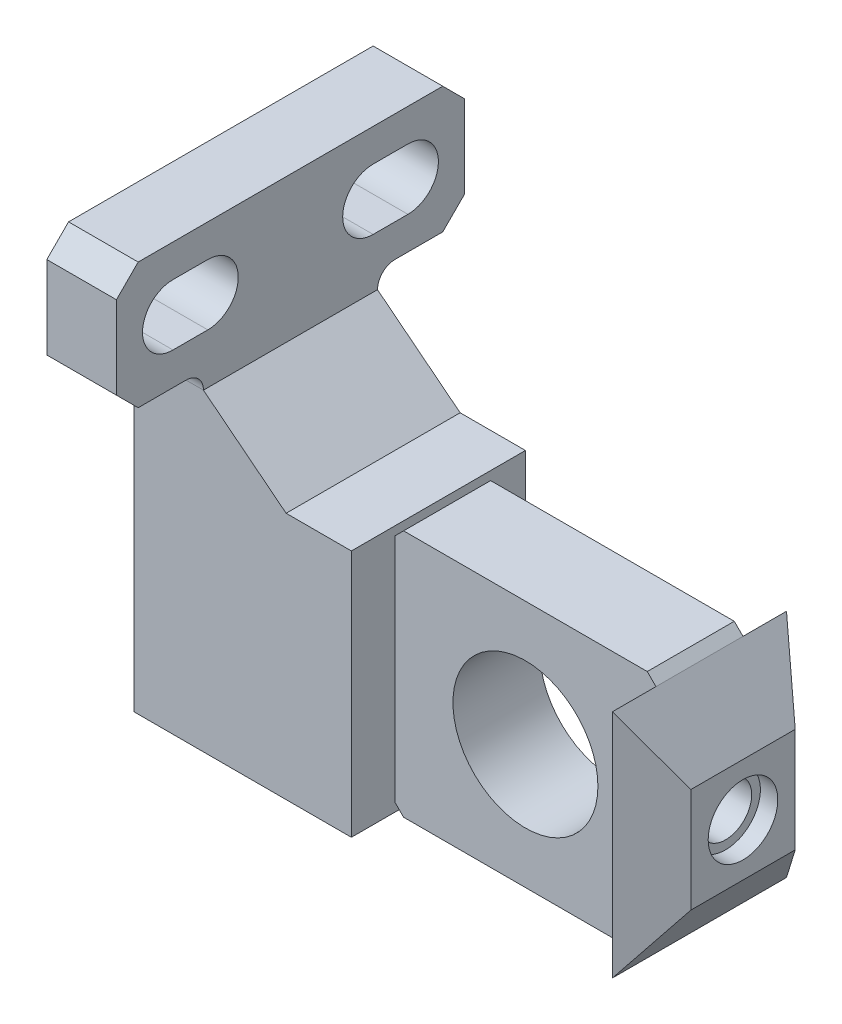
ISO-10303-21;
HEADER;
FILE_DESCRIPTION(('STEP AP214'),'2;1');
FILE_NAME('part.step','',(''),(''),'','','');
FILE_SCHEMA(('AUTOMOTIVE_DESIGN { 1 0 10303 214 1 1 1 1 }'));
ENDSEC;
DATA;
#1=APPLICATION_CONTEXT('core data for automotive mechanical design processes');
#2=APPLICATION_PROTOCOL_DEFINITION('international standard','automotive_design',2000,#1);
#3=PRODUCT_CONTEXT('',#1,'mechanical');
#4=PRODUCT('Part','Part','',(#3));
#5=PRODUCT_RELATED_PRODUCT_CATEGORY('part','',(#4));
#6=PRODUCT_DEFINITION_FORMATION('','',#4);
#7=PRODUCT_DEFINITION_CONTEXT('part definition',#1,'design');
#8=PRODUCT_DEFINITION('design','',#6,#7);
#9=PRODUCT_DEFINITION_SHAPE('','',#8);
#10=(LENGTH_UNIT() NAMED_UNIT(*) SI_UNIT(.MILLI.,.METRE.));
#11=(NAMED_UNIT(*) PLANE_ANGLE_UNIT() SI_UNIT($,.RADIAN.));
#12=(NAMED_UNIT(*) SI_UNIT($,.STERADIAN.) SOLID_ANGLE_UNIT());
#13=UNCERTAINTY_MEASURE_WITH_UNIT(LENGTH_MEASURE(1.E-05),#10,'distance_accuracy_value','');
#14=(GEOMETRIC_REPRESENTATION_CONTEXT(3) GLOBAL_UNCERTAINTY_ASSIGNED_CONTEXT((#13)) GLOBAL_UNIT_ASSIGNED_CONTEXT((#10,
#11,#12)) REPRESENTATION_CONTEXT('',''));
#15=CARTESIAN_POINT('',(0.,0.,0.));
#16=DIRECTION('',(0.,0.,1.));
#17=DIRECTION('',(1.,0.,0.));
#18=AXIS2_PLACEMENT_3D('',#15,#16,#17);
#19=CARTESIAN_POINT('',(-14.,14.25,5.));
#20=DIRECTION('',(0.707106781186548,-0.707106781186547,0.));
#21=DIRECTION('',(0.707106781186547,0.707106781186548,0.));
#22=AXIS2_PLACEMENT_3D('',#19,#20,#21);
#23=PLANE('',#22);
#24=DIRECTION('',(0.,0.,-1.));
#25=VECTOR('',#24,1.);
#26=CARTESIAN_POINT('',(-14.,14.25,5.));
#27=LINE('',#26,#25);
#28=CARTESIAN_POINT('',(-14.,14.25,5.));
#29=VERTEX_POINT('',#28);
#30=CARTESIAN_POINT('',(-14.,14.25,-5.));
#31=VERTEX_POINT('',#30);
#32=EDGE_CURVE('E548',#29,#31,#27,.T.);
#33=ORIENTED_EDGE('',*,*,#32,.T.);
#34=DIRECTION('',(-0.707106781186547,-0.707106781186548,0.));
#35=VECTOR('',#34,1.);
#36=CARTESIAN_POINT('',(-14.,14.25,-5.));
#37=LINE('',#36,#35);
#38=CARTESIAN_POINT('',(-15.,13.25,-5.));
#39=VERTEX_POINT('',#38);
#40=EDGE_CURVE('E510',#31,#39,#37,.T.);
#41=ORIENTED_EDGE('',*,*,#40,.T.);
#42=DIRECTION('',(0.,0.,-1.));
#43=VECTOR('',#42,1.);
#44=CARTESIAN_POINT('',(-15.,13.25,5.));
#45=LINE('',#44,#43);
#46=CARTESIAN_POINT('',(-15.,13.25,5.));
#47=VERTEX_POINT('',#46);
#48=EDGE_CURVE('E11',#47,#39,#45,.T.);
#49=ORIENTED_EDGE('',*,*,#48,.F.);
#50=DIRECTION('',(-0.707106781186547,-0.707106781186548,0.));
#51=VECTOR('',#50,1.);
#52=CARTESIAN_POINT('',(-14.,14.25,5.));
#53=LINE('',#52,#51);
#54=EDGE_CURVE('E533',#29,#47,#53,.T.);
#55=ORIENTED_EDGE('',*,*,#54,.F.);
#56=EDGE_LOOP('',(#33,#41,#49,#55));
#57=FACE_BOUND('',#56,.T.);
#58=ADVANCED_FACE('F35',(#57),#23,.F.);
#59=CARTESIAN_POINT('',(-15.,-13.25,5.));
#60=DIRECTION('',(0.707106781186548,0.707106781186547,0.));
#61=DIRECTION('',(-0.707106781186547,0.707106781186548,0.));
#62=AXIS2_PLACEMENT_3D('',#59,#60,#61);
#63=PLANE('',#62);
#64=DIRECTION('',(0.,0.,-1.));
#65=VECTOR('',#64,1.);
#66=CARTESIAN_POINT('',(-15.,-13.25,5.));
#67=LINE('',#66,#65);
#68=CARTESIAN_POINT('',(-15.,-13.25,5.));
#69=VERTEX_POINT('',#68);
#70=CARTESIAN_POINT('',(-15.,-13.25,-5.));
#71=VERTEX_POINT('',#70);
#72=EDGE_CURVE('E42',#69,#71,#67,.T.);
#73=ORIENTED_EDGE('',*,*,#72,.T.);
#74=DIRECTION('',(0.707106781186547,-0.707106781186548,0.));
#75=VECTOR('',#74,1.);
#76=CARTESIAN_POINT('',(-15.,-13.25,-5.));
#77=LINE('',#76,#75);
#78=CARTESIAN_POINT('',(-14.,-14.25,-5.));
#79=VERTEX_POINT('',#78);
#80=EDGE_CURVE('E516',#71,#79,#77,.T.);
#81=ORIENTED_EDGE('',*,*,#80,.T.);
#82=DIRECTION('',(0.,0.,-1.));
#83=VECTOR('',#82,1.);
#84=CARTESIAN_POINT('',(-14.,-14.25,5.));
#85=LINE('',#84,#83);
#86=CARTESIAN_POINT('',(-14.,-14.25,5.));
#87=VERTEX_POINT('',#86);
#88=EDGE_CURVE('E560',#87,#79,#85,.T.);
#89=ORIENTED_EDGE('',*,*,#88,.F.);
#90=DIRECTION('',(0.707106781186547,-0.707106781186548,0.));
#91=VECTOR('',#90,1.);
#92=CARTESIAN_POINT('',(-15.,-13.25,5.));
#93=LINE('',#92,#91);
#94=EDGE_CURVE('E537',#69,#87,#93,.T.);
#95=ORIENTED_EDGE('',*,*,#94,.F.);
#96=EDGE_LOOP('',(#73,#81,#89,#95));
#97=FACE_BOUND('',#96,.T.);
#98=ADVANCED_FACE('F565',(#97),#63,.F.);
#99=CARTESIAN_POINT('',(-14.,-14.25,5.));
#100=DIRECTION('',(0.,1.,0.));
#101=DIRECTION('',(0.,0.,1.));
#102=AXIS2_PLACEMENT_3D('',#99,#100,#101);
#103=PLANE('',#102);
#104=ORIENTED_EDGE('',*,*,#88,.T.);
#105=DIRECTION('',(1.,0.,0.));
#106=VECTOR('',#105,1.);
#107=CARTESIAN_POINT('',(-14.,-14.25,-5.));
#108=LINE('',#107,#106);
#109=CARTESIAN_POINT('',(14.,-14.25,-5.));
#110=VERTEX_POINT('',#109);
#111=EDGE_CURVE('E519',#79,#110,#108,.T.);
#112=ORIENTED_EDGE('',*,*,#111,.T.);
#113=DIRECTION('',(0.,0.,-1.));
#114=VECTOR('',#113,1.);
#115=CARTESIAN_POINT('',(14.,-14.25,5.));
#116=LINE('',#115,#114);
#117=CARTESIAN_POINT('',(14.,-14.25,5.));
#118=VERTEX_POINT('',#117);
#119=EDGE_CURVE('E558',#118,#110,#116,.T.);
#120=ORIENTED_EDGE('',*,*,#119,.F.);
#121=DIRECTION('',(1.,0.,0.));
#122=VECTOR('',#121,1.);
#123=CARTESIAN_POINT('',(-14.,-14.25,5.));
#124=LINE('',#123,#122);
#125=EDGE_CURVE('E539',#87,#118,#124,.T.);
#126=ORIENTED_EDGE('',*,*,#125,.F.);
#127=EDGE_LOOP('',(#104,#112,#120,#126));
#128=FACE_BOUND('',#127,.T.);
#129=ADVANCED_FACE('F628',(#128),#103,.F.);
#130=CARTESIAN_POINT('',(14.,-14.25,5.));
#131=DIRECTION('',(-0.707106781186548,0.707106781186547,0.));
#132=DIRECTION('',(-0.707106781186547,-0.707106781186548,0.));
#133=AXIS2_PLACEMENT_3D('',#130,#131,#132);
#134=PLANE('',#133);
#135=ORIENTED_EDGE('',*,*,#119,.T.);
#136=DIRECTION('',(0.707106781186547,0.707106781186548,0.));
#137=VECTOR('',#136,1.);
#138=CARTESIAN_POINT('',(14.,-14.25,-5.));
#139=LINE('',#138,#137);
#140=CARTESIAN_POINT('',(15.,-13.25,-5.));
#141=VERTEX_POINT('',#140);
#142=EDGE_CURVE('E522',#110,#141,#139,.T.);
#143=ORIENTED_EDGE('',*,*,#142,.T.);
#144=DIRECTION('',(0.,0.,-1.));
#145=VECTOR('',#144,1.);
#146=CARTESIAN_POINT('',(15.,-13.25,5.));
#147=LINE('',#146,#145);
#148=CARTESIAN_POINT('',(15.,-13.25,5.));
#149=VERTEX_POINT('',#148);
#150=EDGE_CURVE('E555',#149,#141,#147,.T.);
#151=ORIENTED_EDGE('',*,*,#150,.F.);
#152=DIRECTION('',(0.707106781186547,0.707106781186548,0.));
#153=VECTOR('',#152,1.);
#154=CARTESIAN_POINT('',(14.,-14.25,5.));
#155=LINE('',#154,#153);
#156=EDGE_CURVE('E541',#118,#149,#155,.T.);
#157=ORIENTED_EDGE('',*,*,#156,.F.);
#158=EDGE_LOOP('',(#135,#143,#151,#157));
#159=FACE_BOUND('',#158,.T.);
#160=ADVANCED_FACE('F632',(#159),#134,.F.);
#161=CARTESIAN_POINT('',(15.,13.25,5.));
#162=DIRECTION('',(-0.707106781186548,-0.707106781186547,0.));
#163=DIRECTION('',(0.707106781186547,-0.707106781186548,0.));
#164=AXIS2_PLACEMENT_3D('',#161,#162,#163);
#165=PLANE('',#164);
#166=DIRECTION('',(0.,0.,-1.));
#167=VECTOR('',#166,1.);
#168=CARTESIAN_POINT('',(15.,13.25,5.));
#169=LINE('',#168,#167);
#170=CARTESIAN_POINT('',(15.,13.25,5.));
#171=VERTEX_POINT('',#170);
#172=CARTESIAN_POINT('',(15.,13.25,-5.));
#173=VERTEX_POINT('',#172);
#174=EDGE_CURVE('E552',#171,#173,#169,.T.);
#175=ORIENTED_EDGE('',*,*,#174,.T.);
#176=DIRECTION('',(-0.707106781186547,0.707106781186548,0.));
#177=VECTOR('',#176,1.);
#178=CARTESIAN_POINT('',(15.,13.25,-5.));
#179=LINE('',#178,#177);
#180=CARTESIAN_POINT('',(14.,14.25,-5.));
#181=VERTEX_POINT('',#180);
#182=EDGE_CURVE('E527',#173,#181,#179,.T.);
#183=ORIENTED_EDGE('',*,*,#182,.T.);
#184=DIRECTION('',(0.,0.,-1.));
#185=VECTOR('',#184,1.);
#186=CARTESIAN_POINT('',(14.,14.25,5.));
#187=LINE('',#186,#185);
#188=CARTESIAN_POINT('',(14.,14.25,5.));
#189=VERTEX_POINT('',#188);
#190=EDGE_CURVE('E550',#189,#181,#187,.T.);
#191=ORIENTED_EDGE('',*,*,#190,.F.);
#192=DIRECTION('',(-0.707106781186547,0.707106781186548,0.));
#193=VECTOR('',#192,1.);
#194=CARTESIAN_POINT('',(15.,13.25,5.));
#195=LINE('',#194,#193);
#196=EDGE_CURVE('E54',#171,#189,#195,.T.);
#197=ORIENTED_EDGE('',*,*,#196,.F.);
#198=EDGE_LOOP('',(#175,#183,#191,#197));
#199=FACE_BOUND('',#198,.T.);
#200=ADVANCED_FACE('F585',(#199),#165,.F.);
#201=CARTESIAN_POINT('',(14.,14.25,5.));
#202=DIRECTION('',(0.,-1.,0.));
#203=DIRECTION('',(0.,0.,-1.));
#204=AXIS2_PLACEMENT_3D('',#201,#202,#203);
#205=PLANE('',#204);
#206=ORIENTED_EDGE('',*,*,#190,.T.);
#207=DIRECTION('',(-1.,0.,0.));
#208=VECTOR('',#207,1.);
#209=CARTESIAN_POINT('',(14.,14.25,-5.));
#210=LINE('',#209,#208);
#211=EDGE_CURVE('E530',#181,#31,#210,.T.);
#212=ORIENTED_EDGE('',*,*,#211,.T.);
#213=ORIENTED_EDGE('',*,*,#32,.F.);
#214=DIRECTION('',(-1.,0.,0.));
#215=VECTOR('',#214,1.);
#216=CARTESIAN_POINT('',(14.,14.25,5.));
#217=LINE('',#216,#215);
#218=EDGE_CURVE('E49',#189,#29,#217,.T.);
#219=ORIENTED_EDGE('',*,*,#218,.F.);
#220=EDGE_LOOP('',(#206,#212,#213,#219));
#221=FACE_BOUND('',#220,.T.);
#222=ADVANCED_FACE('F580',(#221),#205,.F.);
#223=CARTESIAN_POINT('',(0.,0.,5.));
#224=DIRECTION('',(0.,0.,1.));
#225=DIRECTION('',(1.,0.,0.));
#226=AXIS2_PLACEMENT_3D('',#223,#224,#225);
#227=PLANE('',#226);
#228=CARTESIAN_POINT('',(0.,0.,5.));
#229=DIRECTION('',(0.,0.,1.));
#230=DIRECTION('',(1.,0.,0.));
#231=AXIS2_PLACEMENT_3D('',#228,#229,#230);
#232=CIRCLE('',#231,8.331);
#233=CARTESIAN_POINT('',(8.331,0.,5.));
#234=VERTEX_POINT('',#233);
#235=EDGE_CURVE('E507',#234,#234,#232,.T.);
#236=ORIENTED_EDGE('',*,*,#235,.F.);
#237=EDGE_LOOP('',(#236));
#238=FACE_BOUND('',#237,.T.);
#239=ORIENTED_EDGE('',*,*,#54,.T.);
#240=DIRECTION('',(0.,-1.,0.));
#241=VECTOR('',#240,1.);
#242=CARTESIAN_POINT('',(-15.,13.25,5.));
#243=LINE('',#242,#241);
#244=EDGE_CURVE('E535',#47,#69,#243,.T.);
#245=ORIENTED_EDGE('',*,*,#244,.T.);
#246=ORIENTED_EDGE('',*,*,#94,.T.);
#247=ORIENTED_EDGE('',*,*,#125,.T.);
#248=ORIENTED_EDGE('',*,*,#156,.T.);
#249=DIRECTION('',(0.,1.,0.));
#250=VECTOR('',#249,1.);
#251=CARTESIAN_POINT('',(15.,-13.25,5.));
#252=LINE('',#251,#250);
#253=EDGE_CURVE('E544',#149,#171,#252,.T.);
#254=ORIENTED_EDGE('',*,*,#253,.T.);
#255=ORIENTED_EDGE('',*,*,#196,.T.);
#256=ORIENTED_EDGE('',*,*,#218,.T.);
#257=EDGE_LOOP('',(#239,#245,#246,#247,#248,#254,#255,#256));
#258=FACE_BOUND('',#257,.T.);
#259=ADVANCED_FACE('F592',(#238,#258),#227,.T.);
#260=CARTESIAN_POINT('',(0.,0.,-5.));
#261=DIRECTION('',(0.,0.,1.));
#262=DIRECTION('',(1.,0.,0.));
#263=AXIS2_PLACEMENT_3D('',#260,#261,#262);
#264=PLANE('',#263);
#265=CARTESIAN_POINT('',(0.,0.,-5.));
#266=DIRECTION('',(0.,0.,1.));
#267=DIRECTION('',(1.,0.,0.));
#268=AXIS2_PLACEMENT_3D('',#265,#266,#267);
#269=CIRCLE('',#268,8.331);
#270=CARTESIAN_POINT('',(8.331,0.,-5.));
#271=VERTEX_POINT('',#270);
#272=EDGE_CURVE('E504',#271,#271,#269,.T.);
#273=ORIENTED_EDGE('',*,*,#272,.T.);
#274=EDGE_LOOP('',(#273));
#275=FACE_BOUND('',#274,.T.);
#276=ORIENTED_EDGE('',*,*,#40,.F.);
#277=ORIENTED_EDGE('',*,*,#211,.F.);
#278=ORIENTED_EDGE('',*,*,#182,.F.);
#279=DIRECTION('',(0.,1.,0.));
#280=VECTOR('',#279,1.);
#281=CARTESIAN_POINT('',(15.,-13.25,-5.));
#282=LINE('',#281,#280);
#283=EDGE_CURVE('E525',#141,#173,#282,.T.);
#284=ORIENTED_EDGE('',*,*,#283,.F.);
#285=ORIENTED_EDGE('',*,*,#142,.F.);
#286=ORIENTED_EDGE('',*,*,#111,.F.);
#287=ORIENTED_EDGE('',*,*,#80,.F.);
#288=DIRECTION('',(0.,-1.,0.));
#289=VECTOR('',#288,1.);
#290=CARTESIAN_POINT('',(-15.,13.25,-5.));
#291=LINE('',#290,#289);
#292=EDGE_CURVE('E513',#39,#71,#291,.T.);
#293=ORIENTED_EDGE('',*,*,#292,.F.);
#294=EDGE_LOOP('',(#276,#277,#278,#284,#285,#286,#287,#293));
#295=FACE_BOUND('',#294,.T.);
#296=ADVANCED_FACE('F574',(#275,#295),#264,.F.);
#297=CARTESIAN_POINT('',(0.,0.,-5.));
#298=DIRECTION('',(0.,0.,1.));
#299=DIRECTION('',(1.,0.,0.));
#300=AXIS2_PLACEMENT_3D('',#297,#298,#299);
#301=CYLINDRICAL_SURFACE('',#300,8.331);
#302=ORIENTED_EDGE('',*,*,#235,.T.);
#303=EDGE_LOOP('',(#302));
#304=FACE_BOUND('',#303,.T.);
#305=ORIENTED_EDGE('',*,*,#272,.F.);
#306=EDGE_LOOP('',(#305));
#307=FACE_BOUND('',#306,.T.);
#308=ADVANCED_FACE('F648',(#304,#307),#301,.F.);
#309=CARTESIAN_POINT('',(15.,13.25,10.));
#310=DIRECTION('',(1.,0.,0.));
#311=DIRECTION('',(0.,0.,-1.));
#312=AXIS2_PLACEMENT_3D('',#309,#310,#311);
#313=PLANE('',#312);
#314=DIRECTION('',(0.,0.,-1.));
#315=VECTOR('',#314,1.);
#316=CARTESIAN_POINT('',(15.,-13.25,10.));
#317=LINE('',#316,#315);
#318=CARTESIAN_POINT('',(15.,-13.25,-10.));
#319=VERTEX_POINT('',#318);
#320=EDGE_CURVE('E497',#141,#319,#317,.T.);
#321=ORIENTED_EDGE('',*,*,#320,.F.);
#322=ORIENTED_EDGE('',*,*,#283,.T.);
#323=DIRECTION('',(0.,0.,-1.));
#324=VECTOR('',#323,1.);
#325=CARTESIAN_POINT('',(15.,13.25,10.));
#326=LINE('',#325,#324);
#327=CARTESIAN_POINT('',(15.,13.25,-10.));
#328=VERTEX_POINT('',#327);
#329=EDGE_CURVE('E501',#173,#328,#326,.T.);
#330=ORIENTED_EDGE('',*,*,#329,.T.);
#331=DIRECTION('',(0.,-1.,0.));
#332=VECTOR('',#331,1.);
#333=CARTESIAN_POINT('',(15.,13.25,-10.));
#334=LINE('',#333,#332);
#335=EDGE_CURVE('E486',#328,#319,#334,.T.);
#336=ORIENTED_EDGE('',*,*,#335,.T.);
#337=EDGE_LOOP('',(#321,#322,#330,#336));
#338=FACE_BOUND('',#337,.T.);
#339=ADVANCED_FACE('F611',(#338),#313,.F.);
#340=CARTESIAN_POINT('',(20.,6.00000000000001,10.));
#341=DIRECTION('',(-0.823212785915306,-0.56773295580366,0.));
#342=DIRECTION('',(0.56773295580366,-0.823212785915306,0.));
#343=AXIS2_PLACEMENT_3D('',#340,#341,#342);
#344=PLANE('',#343);
#345=CARTESIAN_POINT('',(15.,13.25,10.));
#346=VERTEX_POINT('',#345);
#347=EDGE_CURVE('E502',#346,#171,#326,.T.);
#348=ORIENTED_EDGE('',*,*,#347,.F.);
#349=DIRECTION('',(0.516914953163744,-0.749526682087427,-0.413531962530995));
#350=VECTOR('',#349,1.);
#351=CARTESIAN_POINT('',(19.1449565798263,7.23981295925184,6.68403473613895));
#352=LINE('',#351,#350);
#353=CARTESIAN_POINT('',(20.,6.00000000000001,6.));
#354=VERTEX_POINT('',#353);
#355=EDGE_CURVE('E483',#346,#354,#352,.T.);
#356=ORIENTED_EDGE('',*,*,#355,.T.);
#357=DIRECTION('',(0.,0.,-1.));
#358=VECTOR('',#357,1.);
#359=CARTESIAN_POINT('',(20.,6.00000000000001,10.));
#360=LINE('',#359,#358);
#361=CARTESIAN_POINT('',(20.,6.00000000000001,-6.00000000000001));
#362=VERTEX_POINT('',#361);
#363=EDGE_CURVE('E491',#354,#362,#360,.T.);
#364=ORIENTED_EDGE('',*,*,#363,.T.);
#365=DIRECTION('',(-0.516914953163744,0.749526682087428,-0.413531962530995));
#366=VECTOR('',#365,1.);
#367=CARTESIAN_POINT('',(23.4201736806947,1.04074816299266,-3.26386105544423));
#368=LINE('',#367,#366);
#369=EDGE_CURVE('E477',#362,#328,#368,.T.);
#370=ORIENTED_EDGE('',*,*,#369,.T.);
#371=ORIENTED_EDGE('',*,*,#329,.F.);
#372=ORIENTED_EDGE('',*,*,#174,.F.);
#373=EDGE_LOOP('',(#348,#356,#364,#370,#371,#372));
#374=FACE_BOUND('',#373,.T.);
#375=ADVANCED_FACE('F590',(#374),#344,.F.);
#376=ORIENTED_EDGE('',*,*,#253,.F.);
#377=CARTESIAN_POINT('',(15.,-13.25,10.));
#378=VERTEX_POINT('',#377);
#379=EDGE_CURVE('E498',#378,#149,#317,.T.);
#380=ORIENTED_EDGE('',*,*,#379,.F.);
#381=DIRECTION('',(0.,-1.,0.));
#382=VECTOR('',#381,1.);
#383=CARTESIAN_POINT('',(15.,13.25,10.));
#384=LINE('',#383,#382);
#385=EDGE_CURVE('E489',#346,#378,#384,.T.);
#386=ORIENTED_EDGE('',*,*,#385,.F.);
#387=ORIENTED_EDGE('',*,*,#347,.T.);
#388=EDGE_LOOP('',(#376,#380,#386,#387));
#389=FACE_BOUND('',#388,.T.);
#390=ADVANCED_FACE('F597',(#389),#313,.F.);
#391=CARTESIAN_POINT('',(15.,-13.25,10.));
#392=DIRECTION('',(-0.823212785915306,0.56773295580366,0.));
#393=DIRECTION('',(-0.56773295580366,-0.823212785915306,0.));
#394=AXIS2_PLACEMENT_3D('',#391,#392,#393);
#395=PLANE('',#394);
#396=DIRECTION('',(0.,0.,-1.));
#397=VECTOR('',#396,1.);
#398=CARTESIAN_POINT('',(20.,-6.,10.));
#399=LINE('',#398,#397);
#400=CARTESIAN_POINT('',(20.,-6.,6.));
#401=VERTEX_POINT('',#400);
#402=CARTESIAN_POINT('',(20.,-6.,-6.00000000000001));
#403=VERTEX_POINT('',#402);
#404=EDGE_CURVE('E494',#401,#403,#399,.T.);
#405=ORIENTED_EDGE('',*,*,#404,.F.);
#406=DIRECTION('',(-0.516914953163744,-0.749526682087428,0.413531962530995));
#407=VECTOR('',#406,1.);
#408=CARTESIAN_POINT('',(15.,-13.25,10.));
#409=LINE('',#408,#407);
#410=EDGE_CURVE('E480',#401,#378,#409,.T.);
#411=ORIENTED_EDGE('',*,*,#410,.T.);
#412=ORIENTED_EDGE('',*,*,#379,.T.);
#413=ORIENTED_EDGE('',*,*,#150,.T.);
#414=ORIENTED_EDGE('',*,*,#320,.T.);
#415=DIRECTION('',(0.516914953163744,0.749526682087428,0.413531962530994));
#416=VECTOR('',#415,1.);
#417=CARTESIAN_POINT('',(19.2752171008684,-7.05093520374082,-6.57982631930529));
#418=LINE('',#417,#416);
#419=EDGE_CURVE('E472',#319,#403,#418,.T.);
#420=ORIENTED_EDGE('',*,*,#419,.T.);
#421=EDGE_LOOP('',(#405,#411,#412,#413,#414,#420));
#422=FACE_BOUND('',#421,.T.);
#423=ADVANCED_FACE('F601',(#422),#395,.F.);
#424=CARTESIAN_POINT('',(20.,-6.,10.));
#425=DIRECTION('',(-1.,0.,0.));
#426=DIRECTION('',(0.,0.,1.));
#427=AXIS2_PLACEMENT_3D('',#424,#425,#426);
#428=PLANE('',#427);
#429=CARTESIAN_POINT('',(20.,0.,0.));
#430=DIRECTION('',(-1.,0.,0.));
#431=DIRECTION('',(0.,0.,1.));
#432=AXIS2_PLACEMENT_3D('',#429,#430,#431);
#433=CIRCLE('',#432,4.);
#434=CARTESIAN_POINT('',(20.,0.,4.));
#435=VERTEX_POINT('',#434);
#436=EDGE_CURVE('E457',#435,#435,#433,.T.);
#437=ORIENTED_EDGE('',*,*,#436,.T.);
#438=EDGE_LOOP('',(#437));
#439=FACE_BOUND('',#438,.T.);
#440=ORIENTED_EDGE('',*,*,#363,.F.);
#441=DIRECTION('',(0.,1.,0.));
#442=VECTOR('',#441,1.);
#443=CARTESIAN_POINT('',(20.,-13.25,6.));
#444=LINE('',#443,#442);
#445=EDGE_CURVE('E470',#401,#354,#444,.T.);
#446=ORIENTED_EDGE('',*,*,#445,.F.);
#447=ORIENTED_EDGE('',*,*,#404,.T.);
#448=DIRECTION('',(0.,1.,0.));
#449=VECTOR('',#448,1.);
#450=CARTESIAN_POINT('',(20.,-13.25,-6.00000000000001));
#451=LINE('',#450,#449);
#452=EDGE_CURVE('E469',#403,#362,#451,.T.);
#453=ORIENTED_EDGE('',*,*,#452,.T.);
#454=EDGE_LOOP('',(#440,#446,#447,#453));
#455=FACE_BOUND('',#454,.T.);
#456=ADVANCED_FACE('F608',(#439,#455),#428,.F.);
#457=CARTESIAN_POINT('',(15.,-13.25,-10.));
#458=DIRECTION('',(-0.624695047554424,0.,0.780868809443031));
#459=DIRECTION('',(0.780868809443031,0.,0.624695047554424));
#460=AXIS2_PLACEMENT_3D('',#457,#458,#459);
#461=PLANE('',#460);
#462=ORIENTED_EDGE('',*,*,#452,.F.);
#463=ORIENTED_EDGE('',*,*,#419,.F.);
#464=ORIENTED_EDGE('',*,*,#335,.F.);
#465=ORIENTED_EDGE('',*,*,#369,.F.);
#466=EDGE_LOOP('',(#462,#463,#464,#465));
#467=FACE_BOUND('',#466,.T.);
#468=ADVANCED_FACE('F612',(#467),#461,.F.);
#469=CARTESIAN_POINT('',(20.,-13.25,6.));
#470=DIRECTION('',(-0.624695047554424,0.,-0.78086880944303));
#471=DIRECTION('',(-0.78086880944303,0.,0.624695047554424));
#472=AXIS2_PLACEMENT_3D('',#469,#470,#471);
#473=PLANE('',#472);
#474=ORIENTED_EDGE('',*,*,#385,.T.);
#475=ORIENTED_EDGE('',*,*,#410,.F.);
#476=ORIENTED_EDGE('',*,*,#445,.T.);
#477=ORIENTED_EDGE('',*,*,#355,.F.);
#478=EDGE_LOOP('',(#474,#475,#476,#477));
#479=FACE_BOUND('',#478,.T.);
#480=ADVANCED_FACE('F605',(#479),#473,.F.);
#481=CARTESIAN_POINT('',(12.,0.,0.));
#482=DIRECTION('',(1.,0.,0.));
#483=DIRECTION('',(0.,0.,-1.));
#484=AXIS2_PLACEMENT_3D('',#481,#482,#483);
#485=PLANE('',#484);
#486=CARTESIAN_POINT('',(12.,0.,0.));
#487=DIRECTION('',(-1.,0.,0.));
#488=DIRECTION('',(0.,0.,1.));
#489=AXIS2_PLACEMENT_3D('',#486,#487,#488);
#490=CIRCLE('',#489,3.);
#491=CARTESIAN_POINT('',(12.,0.,3.));
#492=VERTEX_POINT('',#491);
#493=EDGE_CURVE('E466',#492,#492,#490,.T.);
#494=ORIENTED_EDGE('',*,*,#493,.F.);
#495=EDGE_LOOP('',(#494));
#496=FACE_BOUND('',#495,.T.);
#497=ADVANCED_FACE('F619',(#496),#485,.T.);
#498=CARTESIAN_POINT('',(20.,0.,0.));
#499=DIRECTION('',(-1.,0.,0.));
#500=DIRECTION('',(0.,0.,1.));
#501=AXIS2_PLACEMENT_3D('',#498,#499,#500);
#502=CYLINDRICAL_SURFACE('',#501,3.);
#503=ORIENTED_EDGE('',*,*,#493,.T.);
#504=EDGE_LOOP('',(#503));
#505=FACE_BOUND('',#504,.T.);
#506=CARTESIAN_POINT('',(18.,0.,0.));
#507=DIRECTION('',(-1.,0.,0.));
#508=DIRECTION('',(0.,0.,1.));
#509=AXIS2_PLACEMENT_3D('',#506,#507,#508);
#510=CIRCLE('',#509,3.);
#511=CARTESIAN_POINT('',(18.,0.,3.));
#512=VERTEX_POINT('',#511);
#513=EDGE_CURVE('E463',#512,#512,#510,.T.);
#514=ORIENTED_EDGE('',*,*,#513,.F.);
#515=EDGE_LOOP('',(#514));
#516=FACE_BOUND('',#515,.T.);
#517=ADVANCED_FACE('F800',(#505,#516),#502,.F.);
#518=CARTESIAN_POINT('',(18.,3.,0.));
#519=DIRECTION('',(1.,0.,0.));
#520=DIRECTION('',(0.,0.,-1.));
#521=AXIS2_PLACEMENT_3D('',#518,#519,#520);
#522=PLANE('',#521);
#523=ORIENTED_EDGE('',*,*,#513,.T.);
#524=EDGE_LOOP('',(#523));
#525=FACE_BOUND('',#524,.T.);
#526=CARTESIAN_POINT('',(18.,0.,0.));
#527=DIRECTION('',(-1.,0.,0.));
#528=DIRECTION('',(0.,0.,1.));
#529=AXIS2_PLACEMENT_3D('',#526,#527,#528);
#530=CIRCLE('',#529,4.);
#531=CARTESIAN_POINT('',(18.,0.,4.));
#532=VERTEX_POINT('',#531);
#533=EDGE_CURVE('E460',#532,#532,#530,.T.);
#534=ORIENTED_EDGE('',*,*,#533,.F.);
#535=EDGE_LOOP('',(#534));
#536=FACE_BOUND('',#535,.T.);
#537=ADVANCED_FACE('F831',(#525,#536),#522,.T.);
#538=CARTESIAN_POINT('',(20.,0.,0.));
#539=DIRECTION('',(-1.,0.,0.));
#540=DIRECTION('',(0.,0.,1.));
#541=AXIS2_PLACEMENT_3D('',#538,#539,#540);
#542=CYLINDRICAL_SURFACE('',#541,4.);
#543=ORIENTED_EDGE('',*,*,#533,.T.);
#544=EDGE_LOOP('',(#543));
#545=FACE_BOUND('',#544,.T.);
#546=ORIENTED_EDGE('',*,*,#436,.F.);
#547=EDGE_LOOP('',(#546));
#548=FACE_BOUND('',#547,.T.);
#549=ADVANCED_FACE('F836',(#545,#548),#542,.F.);
#550=CARTESIAN_POINT('',(-40.,21.75,10.));
#551=DIRECTION('',(1.,0.,0.));
#552=DIRECTION('',(0.,0.,-1.));
#553=AXIS2_PLACEMENT_3D('',#550,#551,#552);
#554=PLANE('',#553);
#555=DIRECTION('',(0.,-1.,0.));
#556=VECTOR('',#555,1.);
#557=CARTESIAN_POINT('',(-40.,21.75,10.));
#558=LINE('',#557,#556);
#559=CARTESIAN_POINT('',(-40.,21.75,10.));
#560=VERTEX_POINT('',#559);
#561=CARTESIAN_POINT('',(-40.,-14.25,10.));
#562=VERTEX_POINT('',#561);
#563=EDGE_CURVE('E436',#560,#562,#558,.T.);
#564=ORIENTED_EDGE('',*,*,#563,.F.);
#565=CARTESIAN_POINT('',(-40.,21.75,12.));
#566=DIRECTION('',(-1.,0.,0.));
#567=DIRECTION('',(0.,0.,1.));
#568=AXIS2_PLACEMENT_3D('',#565,#566,#567);
#569=CIRCLE('',#568,2.);
#570=CARTESIAN_POINT('',(-40.,23.75,12.));
#571=VERTEX_POINT('',#570);
#572=EDGE_CURVE('E372',#571,#560,#569,.T.);
#573=ORIENTED_EDGE('',*,*,#572,.F.);
#574=DIRECTION('',(0.,0.,-1.));
#575=VECTOR('',#574,1.);
#576=CARTESIAN_POINT('',(-40.,23.75,17.5));
#577=LINE('',#576,#575);
#578=CARTESIAN_POINT('',(-40.,23.75,17.5));
#579=VERTEX_POINT('',#578);
#580=EDGE_CURVE('E370',#579,#571,#577,.T.);
#581=ORIENTED_EDGE('',*,*,#580,.F.);
#582=DIRECTION('',(0.,-0.707106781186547,-0.707106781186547));
#583=VECTOR('',#582,1.);
#584=CARTESIAN_POINT('',(-40.,26.25,20.));
#585=LINE('',#584,#583);
#586=CARTESIAN_POINT('',(-40.,26.25,20.));
#587=VERTEX_POINT('',#586);
#588=EDGE_CURVE('E368',#587,#579,#585,.T.);
#589=ORIENTED_EDGE('',*,*,#588,.F.);
#590=DIRECTION('',(0.,-1.,0.));
#591=VECTOR('',#590,1.);
#592=CARTESIAN_POINT('',(-40.,35.75,20.));
#593=LINE('',#592,#591);
#594=CARTESIAN_POINT('',(-40.,35.75,20.));
#595=VERTEX_POINT('',#594);
#596=EDGE_CURVE('E340',#595,#587,#593,.T.);
#597=ORIENTED_EDGE('',*,*,#596,.F.);
#598=DIRECTION('',(0.,-0.707106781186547,0.707106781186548));
#599=VECTOR('',#598,1.);
#600=CARTESIAN_POINT('',(-40.,38.25,17.5));
#601=LINE('',#600,#599);
#602=CARTESIAN_POINT('',(-40.,38.25,17.5));
#603=VERTEX_POINT('',#602);
#604=EDGE_CURVE('E345',#603,#595,#601,.T.);
#605=ORIENTED_EDGE('',*,*,#604,.F.);
#606=DIRECTION('',(0.,0.,1.));
#607=VECTOR('',#606,1.);
#608=CARTESIAN_POINT('',(-40.,38.25,-17.5));
#609=LINE('',#608,#607);
#610=CARTESIAN_POINT('',(-40.,38.25,-17.5));
#611=VERTEX_POINT('',#610);
#612=EDGE_CURVE('E384',#611,#603,#609,.T.);
#613=ORIENTED_EDGE('',*,*,#612,.F.);
#614=DIRECTION('',(0.,0.707106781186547,0.707106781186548));
#615=VECTOR('',#614,1.);
#616=CARTESIAN_POINT('',(-40.,35.75,-20.));
#617=LINE('',#616,#615);
#618=CARTESIAN_POINT('',(-40.,35.75,-20.));
#619=VERTEX_POINT('',#618);
#620=EDGE_CURVE('E382',#619,#611,#617,.T.);
#621=ORIENTED_EDGE('',*,*,#620,.F.);
#622=DIRECTION('',(0.,1.,0.));
#623=VECTOR('',#622,1.);
#624=CARTESIAN_POINT('',(-40.,26.25,-20.));
#625=LINE('',#624,#623);
#626=CARTESIAN_POINT('',(-40.,26.25,-20.));
#627=VERTEX_POINT('',#626);
#628=EDGE_CURVE('E380',#627,#619,#625,.T.);
#629=ORIENTED_EDGE('',*,*,#628,.F.);
#630=DIRECTION('',(0.,0.707106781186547,-0.707106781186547));
#631=VECTOR('',#630,1.);
#632=CARTESIAN_POINT('',(-40.,23.75,-17.5));
#633=LINE('',#632,#631);
#634=CARTESIAN_POINT('',(-40.,23.75,-17.5));
#635=VERTEX_POINT('',#634);
#636=EDGE_CURVE('E378',#635,#627,#633,.T.);
#637=ORIENTED_EDGE('',*,*,#636,.F.);
#638=DIRECTION('',(0.,0.,-1.));
#639=VECTOR('',#638,1.);
#640=CARTESIAN_POINT('',(-40.,23.75,-12.));
#641=LINE('',#640,#639);
#642=CARTESIAN_POINT('',(-40.,23.75,-12.));
#643=VERTEX_POINT('',#642);
#644=EDGE_CURVE('E376',#643,#635,#641,.T.);
#645=ORIENTED_EDGE('',*,*,#644,.F.);
#646=CARTESIAN_POINT('',(-40.,21.75,-12.));
#647=DIRECTION('',(-1.,0.,0.));
#648=DIRECTION('',(0.,0.,1.));
#649=AXIS2_PLACEMENT_3D('',#646,#647,#648);
#650=CIRCLE('',#649,2.);
#651=CARTESIAN_POINT('',(-40.,21.75,-10.));
#652=VERTEX_POINT('',#651);
#653=EDGE_CURVE('E374',#652,#643,#650,.T.);
#654=ORIENTED_EDGE('',*,*,#653,.F.);
#655=DIRECTION('',(0.,-1.,0.));
#656=VECTOR('',#655,1.);
#657=CARTESIAN_POINT('',(-40.,21.75,-10.));
#658=LINE('',#657,#656);
#659=CARTESIAN_POINT('',(-40.,-14.25,-10.));
#660=VERTEX_POINT('',#659);
#661=EDGE_CURVE('E418',#652,#660,#658,.T.);
#662=ORIENTED_EDGE('',*,*,#661,.T.);
#663=DIRECTION('',(0.,0.,-1.));
#664=VECTOR('',#663,1.);
#665=CARTESIAN_POINT('',(-40.,-14.25,10.));
#666=LINE('',#665,#664);
#667=EDGE_CURVE('E455',#562,#660,#666,.T.);
#668=ORIENTED_EDGE('',*,*,#667,.F.);
#669=EDGE_LOOP('',(#564,#573,#581,#589,#597,#605,#613,#621,#629,#637,#645,#654,#662,#668));
#670=FACE_BOUND('',#669,.T.);
#671=DIRECTION('',(0.,0.,1.));
#672=VECTOR('',#671,1.);
#673=CARTESIAN_POINT('',(-40.,34.5,-13.5));
#674=LINE('',#673,#672);
#675=CARTESIAN_POINT('',(-40.,34.5,-13.5));
#676=VERTEX_POINT('',#675);
#677=CARTESIAN_POINT('',(-40.,34.5,-9.5));
#678=VERTEX_POINT('',#677);
#679=EDGE_CURVE('E313',#676,#678,#674,.T.);
#680=ORIENTED_EDGE('',*,*,#679,.T.);
#681=CARTESIAN_POINT('',(-40.,31.,-9.5));
#682=DIRECTION('',(1.,0.,0.));
#683=DIRECTION('',(0.,0.,-1.));
#684=AXIS2_PLACEMENT_3D('',#681,#682,#683);
#685=CIRCLE('',#684,3.5);
#686=CARTESIAN_POINT('',(-40.,27.5,-9.5));
#687=VERTEX_POINT('',#686);
#688=EDGE_CURVE('E286',#678,#687,#685,.T.);
#689=ORIENTED_EDGE('',*,*,#688,.T.);
#690=DIRECTION('',(0.,0.,-1.));
#691=VECTOR('',#690,1.);
#692=CARTESIAN_POINT('',(-40.,27.5,-9.5));
#693=LINE('',#692,#691);
#694=CARTESIAN_POINT('',(-40.,27.5,-13.5));
#695=VERTEX_POINT('',#694);
#696=EDGE_CURVE('E323',#687,#695,#693,.T.);
#697=ORIENTED_EDGE('',*,*,#696,.T.);
#698=CARTESIAN_POINT('',(-40.,31.,-13.5));
#699=DIRECTION('',(1.,0.,0.));
#700=DIRECTION('',(0.,0.,-1.));
#701=AXIS2_PLACEMENT_3D('',#698,#699,#700);
#702=CIRCLE('',#701,3.5);
#703=EDGE_CURVE('E326',#695,#676,#702,.T.);
#704=ORIENTED_EDGE('',*,*,#703,.T.);
#705=EDGE_LOOP('',(#680,#689,#697,#704));
#706=FACE_BOUND('',#705,.T.);
#707=DIRECTION('',(0.,0.,1.));
#708=VECTOR('',#707,1.);
#709=CARTESIAN_POINT('',(-40.,34.5,9.5));
#710=LINE('',#709,#708);
#711=CARTESIAN_POINT('',(-40.,34.5,9.5));
#712=VERTEX_POINT('',#711);
#713=CARTESIAN_POINT('',(-40.,34.5,13.5));
#714=VERTEX_POINT('',#713);
#715=EDGE_CURVE('E279',#712,#714,#710,.T.);
#716=ORIENTED_EDGE('',*,*,#715,.T.);
#717=CARTESIAN_POINT('',(-40.,31.,13.5));
#718=DIRECTION('',(1.,0.,0.));
#719=DIRECTION('',(0.,0.,-1.));
#720=AXIS2_PLACEMENT_3D('',#717,#718,#719);
#721=CIRCLE('',#720,3.5);
#722=CARTESIAN_POINT('',(-40.,27.5,13.5));
#723=VERTEX_POINT('',#722);
#724=EDGE_CURVE('E298',#714,#723,#721,.T.);
#725=ORIENTED_EDGE('',*,*,#724,.T.);
#726=DIRECTION('',(0.,0.,-1.));
#727=VECTOR('',#726,1.);
#728=CARTESIAN_POINT('',(-40.,27.5,13.5));
#729=LINE('',#728,#727);
#730=CARTESIAN_POINT('',(-40.,27.5,9.5));
#731=VERTEX_POINT('',#730);
#732=EDGE_CURVE('E285',#723,#731,#729,.T.);
#733=ORIENTED_EDGE('',*,*,#732,.T.);
#734=CARTESIAN_POINT('',(-40.,31.,9.5));
#735=DIRECTION('',(1.,0.,0.));
#736=DIRECTION('',(0.,0.,-1.));
#737=AXIS2_PLACEMENT_3D('',#734,#735,#736);
#738=CIRCLE('',#737,3.5);
#739=EDGE_CURVE('E301',#731,#712,#738,.T.);
#740=ORIENTED_EDGE('',*,*,#739,.T.);
#741=EDGE_LOOP('',(#716,#725,#733,#740));
#742=FACE_BOUND('',#741,.T.);
#743=ADVANCED_FACE('F867',(#670,#706,#742),#554,.F.);
#744=CARTESIAN_POINT('',(-40.,-14.25,10.));
#745=DIRECTION('',(0.,1.,0.));
#746=DIRECTION('',(0.,0.,1.));
#747=AXIS2_PLACEMENT_3D('',#744,#745,#746);
#748=PLANE('',#747);
#749=ORIENTED_EDGE('',*,*,#667,.T.);
#750=DIRECTION('',(1.,0.,0.));
#751=VECTOR('',#750,1.);
#752=CARTESIAN_POINT('',(-40.,-14.25,-10.));
#753=LINE('',#752,#751);
#754=CARTESIAN_POINT('',(-15.,-14.25,-10.));
#755=VERTEX_POINT('',#754);
#756=EDGE_CURVE('E421',#660,#755,#753,.T.);
#757=ORIENTED_EDGE('',*,*,#756,.T.);
#758=DIRECTION('',(0.,0.,-1.));
#759=VECTOR('',#758,1.);
#760=CARTESIAN_POINT('',(-15.,-14.25,10.));
#761=LINE('',#760,#759);
#762=CARTESIAN_POINT('',(-15.,-14.25,10.));
#763=VERTEX_POINT('',#762);
#764=EDGE_CURVE('E453',#763,#755,#761,.T.);
#765=ORIENTED_EDGE('',*,*,#764,.F.);
#766=DIRECTION('',(1.,0.,0.));
#767=VECTOR('',#766,1.);
#768=CARTESIAN_POINT('',(-40.,-14.25,10.));
#769=LINE('',#768,#767);
#770=EDGE_CURVE('E438',#562,#763,#769,.T.);
#771=ORIENTED_EDGE('',*,*,#770,.F.);
#772=EDGE_LOOP('',(#749,#757,#765,#771));
#773=FACE_BOUND('',#772,.T.);
#774=ADVANCED_FACE('F872',(#773),#748,.F.);
#775=CARTESIAN_POINT('',(-15.,-14.25,10.));
#776=DIRECTION('',(-1.,0.,0.));
#777=DIRECTION('',(0.,0.,1.));
#778=AXIS2_PLACEMENT_3D('',#775,#776,#777);
#779=PLANE('',#778);
#780=ORIENTED_EDGE('',*,*,#244,.F.);
#781=ORIENTED_EDGE('',*,*,#48,.T.);
#782=ORIENTED_EDGE('',*,*,#292,.T.);
#783=ORIENTED_EDGE('',*,*,#72,.F.);
#784=EDGE_LOOP('',(#780,#781,#782,#783));
#785=FACE_BOUND('',#784,.T.);
#786=ORIENTED_EDGE('',*,*,#764,.T.);
#787=DIRECTION('',(0.,1.,0.));
#788=VECTOR('',#787,1.);
#789=CARTESIAN_POINT('',(-15.,-14.25,-10.));
#790=LINE('',#789,#788);
#791=CARTESIAN_POINT('',(-15.,14.25,-10.));
#792=VERTEX_POINT('',#791);
#793=EDGE_CURVE('E424',#755,#792,#790,.T.);
#794=ORIENTED_EDGE('',*,*,#793,.T.);
#795=DIRECTION('',(0.,0.,-1.));
#796=VECTOR('',#795,1.);
#797=CARTESIAN_POINT('',(-15.,14.25,10.));
#798=LINE('',#797,#796);
#799=CARTESIAN_POINT('',(-15.,14.25,10.));
#800=VERTEX_POINT('',#799);
#801=EDGE_CURVE('E451',#800,#792,#798,.T.);
#802=ORIENTED_EDGE('',*,*,#801,.F.);
#803=DIRECTION('',(0.,1.,0.));
#804=VECTOR('',#803,1.);
#805=CARTESIAN_POINT('',(-15.,-14.25,10.));
#806=LINE('',#805,#804);
#807=EDGE_CURVE('E440',#763,#800,#806,.T.);
#808=ORIENTED_EDGE('',*,*,#807,.F.);
#809=EDGE_LOOP('',(#786,#794,#802,#808));
#810=FACE_BOUND('',#809,.T.);
#811=ADVANCED_FACE('F569',(#785,#810),#779,.F.);
#812=CARTESIAN_POINT('',(-15.,14.25,10.));
#813=DIRECTION('',(0.,-1.,0.));
#814=DIRECTION('',(0.,0.,-1.));
#815=AXIS2_PLACEMENT_3D('',#812,#813,#814);
#816=PLANE('',#815);
#817=ORIENTED_EDGE('',*,*,#801,.T.);
#818=DIRECTION('',(-1.,0.,0.));
#819=VECTOR('',#818,1.);
#820=CARTESIAN_POINT('',(-15.,14.25,-10.));
#821=LINE('',#820,#819);
#822=CARTESIAN_POINT('',(-22.5,14.25,-10.));
#823=VERTEX_POINT('',#822);
#824=EDGE_CURVE('E427',#792,#823,#821,.T.);
#825=ORIENTED_EDGE('',*,*,#824,.T.);
#826=DIRECTION('',(0.,0.,-1.));
#827=VECTOR('',#826,1.);
#828=CARTESIAN_POINT('',(-22.5,14.25,10.));
#829=LINE('',#828,#827);
#830=CARTESIAN_POINT('',(-22.5,14.25,10.));
#831=VERTEX_POINT('',#830);
#832=EDGE_CURVE('E449',#831,#823,#829,.T.);
#833=ORIENTED_EDGE('',*,*,#832,.F.);
#834=DIRECTION('',(-1.,0.,0.));
#835=VECTOR('',#834,1.);
#836=CARTESIAN_POINT('',(-15.,14.25,10.));
#837=LINE('',#836,#835);
#838=EDGE_CURVE('E442',#800,#831,#837,.T.);
#839=ORIENTED_EDGE('',*,*,#838,.F.);
#840=EDGE_LOOP('',(#817,#825,#833,#839));
#841=FACE_BOUND('',#840,.T.);
#842=ADVANCED_FACE('F978',(#841),#816,.F.);
#843=CARTESIAN_POINT('',(-22.5,14.25,10.));
#844=DIRECTION('',(-0.619644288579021,-0.784882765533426,0.));
#845=DIRECTION('',(0.784882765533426,-0.619644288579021,0.));
#846=AXIS2_PLACEMENT_3D('',#843,#844,#845);
#847=PLANE('',#846);
#848=ORIENTED_EDGE('',*,*,#832,.T.);
#849=DIRECTION('',(-0.784882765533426,0.619644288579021,0.));
#850=VECTOR('',#849,1.);
#851=CARTESIAN_POINT('',(-22.5,14.25,-10.));
#852=LINE('',#851,#850);
#853=CARTESIAN_POINT('',(-32.,21.75,-10.));
#854=VERTEX_POINT('',#853);
#855=EDGE_CURVE('E430',#823,#854,#852,.T.);
#856=ORIENTED_EDGE('',*,*,#855,.T.);
#857=DIRECTION('',(0.,0.,-1.));
#858=VECTOR('',#857,1.);
#859=CARTESIAN_POINT('',(-32.,21.75,10.));
#860=LINE('',#859,#858);
#861=CARTESIAN_POINT('',(-32.,21.75,10.));
#862=VERTEX_POINT('',#861);
#863=EDGE_CURVE('E447',#862,#854,#860,.T.);
#864=ORIENTED_EDGE('',*,*,#863,.F.);
#865=DIRECTION('',(-0.784882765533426,0.619644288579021,0.));
#866=VECTOR('',#865,1.);
#867=CARTESIAN_POINT('',(-22.5,14.25,10.));
#868=LINE('',#867,#866);
#869=EDGE_CURVE('E444',#831,#862,#868,.T.);
#870=ORIENTED_EDGE('',*,*,#869,.F.);
#871=EDGE_LOOP('',(#848,#856,#864,#870));
#872=FACE_BOUND('',#871,.T.);
#873=ADVANCED_FACE('F963',(#872),#847,.F.);
#874=CARTESIAN_POINT('',(0.,0.,10.));
#875=DIRECTION('',(0.,0.,1.));
#876=DIRECTION('',(1.,0.,0.));
#877=AXIS2_PLACEMENT_3D('',#874,#875,#876);
#878=PLANE('',#877);
#879=DIRECTION('',(-1.,0.,0.));
#880=VECTOR('',#879,1.);
#881=CARTESIAN_POINT('',(-32.,21.75,10.));
#882=LINE('',#881,#880);
#883=EDGE_CURVE('E433',#862,#560,#882,.T.);
#884=ORIENTED_EDGE('',*,*,#883,.T.);
#885=ORIENTED_EDGE('',*,*,#563,.T.);
#886=ORIENTED_EDGE('',*,*,#770,.T.);
#887=ORIENTED_EDGE('',*,*,#807,.T.);
#888=ORIENTED_EDGE('',*,*,#838,.T.);
#889=ORIENTED_EDGE('',*,*,#869,.T.);
#890=EDGE_LOOP('',(#884,#885,#886,#887,#888,#889));
#891=FACE_BOUND('',#890,.T.);
#892=ADVANCED_FACE('F959',(#891),#878,.T.);
#893=CARTESIAN_POINT('',(0.,0.,-10.));
#894=DIRECTION('',(0.,0.,1.));
#895=DIRECTION('',(1.,0.,0.));
#896=AXIS2_PLACEMENT_3D('',#893,#894,#895);
#897=PLANE('',#896);
#898=DIRECTION('',(-1.,0.,0.));
#899=VECTOR('',#898,1.);
#900=CARTESIAN_POINT('',(-32.,21.75,-10.));
#901=LINE('',#900,#899);
#902=EDGE_CURVE('E416',#854,#652,#901,.T.);
#903=ORIENTED_EDGE('',*,*,#902,.F.);
#904=ORIENTED_EDGE('',*,*,#855,.F.);
#905=ORIENTED_EDGE('',*,*,#824,.F.);
#906=ORIENTED_EDGE('',*,*,#793,.F.);
#907=ORIENTED_EDGE('',*,*,#756,.F.);
#908=ORIENTED_EDGE('',*,*,#661,.F.);
#909=EDGE_LOOP('',(#903,#904,#905,#906,#907,#908));
#910=FACE_BOUND('',#909,.T.);
#911=ADVANCED_FACE('F676',(#910),#897,.F.);
#912=CARTESIAN_POINT('',(-32.,21.75,12.));
#913=DIRECTION('',(-1.,0.,0.));
#914=DIRECTION('',(0.,0.,1.));
#915=AXIS2_PLACEMENT_3D('',#912,#913,#914);
#916=PLANE('',#915);
#917=CARTESIAN_POINT('',(-32.,31.,-9.5));
#918=DIRECTION('',(1.,0.,0.));
#919=DIRECTION('',(0.,0.,-1.));
#920=AXIS2_PLACEMENT_3D('',#917,#918,#919);
#921=CIRCLE('',#920,3.5);
#922=CARTESIAN_POINT('',(-32.,34.5,-9.5));
#923=VERTEX_POINT('',#922);
#924=CARTESIAN_POINT('',(-32.,27.5,-9.5));
#925=VERTEX_POINT('',#924);
#926=EDGE_CURVE('E310',#923,#925,#921,.T.);
#927=ORIENTED_EDGE('',*,*,#926,.F.);
#928=DIRECTION('',(0.,0.,1.));
#929=VECTOR('',#928,1.);
#930=CARTESIAN_POINT('',(-32.,34.5,-13.5));
#931=LINE('',#930,#929);
#932=CARTESIAN_POINT('',(-32.,34.5,-13.5));
#933=VERTEX_POINT('',#932);
#934=EDGE_CURVE('E318',#933,#923,#931,.T.);
#935=ORIENTED_EDGE('',*,*,#934,.F.);
#936=CARTESIAN_POINT('',(-32.,31.,-13.5));
#937=DIRECTION('',(1.,0.,0.));
#938=DIRECTION('',(0.,0.,-1.));
#939=AXIS2_PLACEMENT_3D('',#936,#937,#938);
#940=CIRCLE('',#939,3.5);
#941=CARTESIAN_POINT('',(-32.,27.5,-13.5));
#942=VERTEX_POINT('',#941);
#943=EDGE_CURVE('E315',#942,#933,#940,.T.);
#944=ORIENTED_EDGE('',*,*,#943,.F.);
#945=DIRECTION('',(0.,0.,-1.));
#946=VECTOR('',#945,1.);
#947=CARTESIAN_POINT('',(-32.,27.5,-9.5));
#948=LINE('',#947,#946);
#949=EDGE_CURVE('E312',#925,#942,#948,.T.);
#950=ORIENTED_EDGE('',*,*,#949,.F.);
#951=EDGE_LOOP('',(#927,#935,#944,#950));
#952=FACE_BOUND('',#951,.T.);
#953=DIRECTION('',(0.,-1.,0.));
#954=VECTOR('',#953,1.);
#955=CARTESIAN_POINT('',(-32.,35.75,20.));
#956=LINE('',#955,#954);
#957=CARTESIAN_POINT('',(-32.,35.75,20.));
#958=VERTEX_POINT('',#957);
#959=CARTESIAN_POINT('',(-32.,26.25,20.));
#960=VERTEX_POINT('',#959);
#961=EDGE_CURVE('E341',#958,#960,#956,.T.);
#962=ORIENTED_EDGE('',*,*,#961,.T.);
#963=DIRECTION('',(0.,-0.707106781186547,-0.707106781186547));
#964=VECTOR('',#963,1.);
#965=CARTESIAN_POINT('',(-32.,26.25,20.));
#966=LINE('',#965,#964);
#967=CARTESIAN_POINT('',(-32.,23.75,17.5));
#968=VERTEX_POINT('',#967);
#969=EDGE_CURVE('E344',#960,#968,#966,.T.);
#970=ORIENTED_EDGE('',*,*,#969,.T.);
#971=DIRECTION('',(0.,0.,-1.));
#972=VECTOR('',#971,1.);
#973=CARTESIAN_POINT('',(-32.,23.75,17.5));
#974=LINE('',#973,#972);
#975=CARTESIAN_POINT('',(-32.,23.75,12.));
#976=VERTEX_POINT('',#975);
#977=EDGE_CURVE('E347',#968,#976,#974,.T.);
#978=ORIENTED_EDGE('',*,*,#977,.T.);
#979=CARTESIAN_POINT('',(-32.,21.75,12.));
#980=DIRECTION('',(-1.,0.,0.));
#981=DIRECTION('',(0.,0.,1.));
#982=AXIS2_PLACEMENT_3D('',#979,#980,#981);
#983=CIRCLE('',#982,2.);
#984=EDGE_CURVE('E349',#976,#862,#983,.T.);
#985=ORIENTED_EDGE('',*,*,#984,.T.);
#986=ORIENTED_EDGE('',*,*,#863,.T.);
#987=CARTESIAN_POINT('',(-32.,21.75,-12.));
#988=DIRECTION('',(-1.,0.,0.));
#989=DIRECTION('',(0.,0.,1.));
#990=AXIS2_PLACEMENT_3D('',#987,#988,#989);
#991=CIRCLE('',#990,2.);
#992=CARTESIAN_POINT('',(-32.,23.75,-12.));
#993=VERTEX_POINT('',#992);
#994=EDGE_CURVE('E351',#854,#993,#991,.T.);
#995=ORIENTED_EDGE('',*,*,#994,.T.);
#996=DIRECTION('',(0.,0.,-1.));
#997=VECTOR('',#996,1.);
#998=CARTESIAN_POINT('',(-32.,23.75,-12.));
#999=LINE('',#998,#997);
#1000=CARTESIAN_POINT('',(-32.,23.75,-17.5));
#1001=VERTEX_POINT('',#1000);
#1002=EDGE_CURVE('E353',#993,#1001,#999,.T.);
#1003=ORIENTED_EDGE('',*,*,#1002,.T.);
#1004=DIRECTION('',(0.,0.707106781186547,-0.707106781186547));
#1005=VECTOR('',#1004,1.);
#1006=CARTESIAN_POINT('',(-32.,23.75,-17.5));
#1007=LINE('',#1006,#1005);
#1008=CARTESIAN_POINT('',(-32.,26.25,-20.));
#1009=VERTEX_POINT('',#1008);
#1010=EDGE_CURVE('E355',#1001,#1009,#1007,.T.);
#1011=ORIENTED_EDGE('',*,*,#1010,.T.);
#1012=DIRECTION('',(0.,1.,0.));
#1013=VECTOR('',#1012,1.);
#1014=CARTESIAN_POINT('',(-32.,26.25,-20.));
#1015=LINE('',#1014,#1013);
#1016=CARTESIAN_POINT('',(-32.,35.75,-20.));
#1017=VERTEX_POINT('',#1016);
#1018=EDGE_CURVE('E357',#1009,#1017,#1015,.T.);
#1019=ORIENTED_EDGE('',*,*,#1018,.T.);
#1020=DIRECTION('',(0.,0.707106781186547,0.707106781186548));
#1021=VECTOR('',#1020,1.);
#1022=CARTESIAN_POINT('',(-32.,35.75,-20.));
#1023=LINE('',#1022,#1021);
#1024=CARTESIAN_POINT('',(-32.,38.25,-17.5));
#1025=VERTEX_POINT('',#1024);
#1026=EDGE_CURVE('E359',#1017,#1025,#1023,.T.);
#1027=ORIENTED_EDGE('',*,*,#1026,.T.);
#1028=DIRECTION('',(0.,0.,1.));
#1029=VECTOR('',#1028,1.);
#1030=CARTESIAN_POINT('',(-32.,38.25,-17.5));
#1031=LINE('',#1030,#1029);
#1032=CARTESIAN_POINT('',(-32.,38.25,17.5));
#1033=VERTEX_POINT('',#1032);
#1034=EDGE_CURVE('E361',#1025,#1033,#1031,.T.);
#1035=ORIENTED_EDGE('',*,*,#1034,.T.);
#1036=DIRECTION('',(0.,-0.707106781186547,0.707106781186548));
#1037=VECTOR('',#1036,1.);
#1038=CARTESIAN_POINT('',(-32.,38.25,17.5));
#1039=LINE('',#1038,#1037);
#1040=EDGE_CURVE('E363',#1033,#958,#1039,.T.);
#1041=ORIENTED_EDGE('',*,*,#1040,.T.);
#1042=EDGE_LOOP('',(#962,#970,#978,#985,#986,#995,#1003,#1011,#1019,#1027,#1035,#1041));
#1043=FACE_BOUND('',#1042,.T.);
#1044=CARTESIAN_POINT('',(-32.,31.,13.5));
#1045=DIRECTION('',(1.,0.,0.));
#1046=DIRECTION('',(0.,0.,-1.));
#1047=AXIS2_PLACEMENT_3D('',#1044,#1045,#1046);
#1048=CIRCLE('',#1047,3.5);
#1049=CARTESIAN_POINT('',(-32.,34.5,13.5));
#1050=VERTEX_POINT('',#1049);
#1051=CARTESIAN_POINT('',(-32.,27.5,13.5));
#1052=VERTEX_POINT('',#1051);
#1053=EDGE_CURVE('E268',#1050,#1052,#1048,.T.);
#1054=ORIENTED_EDGE('',*,*,#1053,.F.);
#1055=DIRECTION('',(0.,0.,1.));
#1056=VECTOR('',#1055,1.);
#1057=CARTESIAN_POINT('',(-32.,34.5,9.5));
#1058=LINE('',#1057,#1056);
#1059=CARTESIAN_POINT('',(-32.,34.5,9.5));
#1060=VERTEX_POINT('',#1059);
#1061=EDGE_CURVE('E294',#1060,#1050,#1058,.T.);
#1062=ORIENTED_EDGE('',*,*,#1061,.F.);
#1063=CARTESIAN_POINT('',(-32.,31.,9.5));
#1064=DIRECTION('',(1.,0.,0.));
#1065=DIRECTION('',(0.,0.,-1.));
#1066=AXIS2_PLACEMENT_3D('',#1063,#1064,#1065);
#1067=CIRCLE('',#1066,3.5);
#1068=CARTESIAN_POINT('',(-32.,27.5,9.5));
#1069=VERTEX_POINT('',#1068);
#1070=EDGE_CURVE('E292',#1069,#1060,#1067,.T.);
#1071=ORIENTED_EDGE('',*,*,#1070,.F.);
#1072=DIRECTION('',(0.,0.,-1.));
#1073=VECTOR('',#1072,1.);
#1074=CARTESIAN_POINT('',(-32.,27.5,13.5));
#1075=LINE('',#1074,#1073);
#1076=EDGE_CURVE('E278',#1052,#1069,#1075,.T.);
#1077=ORIENTED_EDGE('',*,*,#1076,.F.);
#1078=EDGE_LOOP('',(#1054,#1062,#1071,#1077));
#1079=FACE_BOUND('',#1078,.T.);
#1080=ADVANCED_FACE('F290',(#952,#1043,#1079),#916,.F.);
#1081=CARTESIAN_POINT('',(-32.,35.75,20.));
#1082=DIRECTION('',(0.,0.,-1.));
#1083=DIRECTION('',(-1.,0.,0.));
#1084=AXIS2_PLACEMENT_3D('',#1081,#1082,#1083);
#1085=PLANE('',#1084);
#1086=ORIENTED_EDGE('',*,*,#596,.T.);
#1087=DIRECTION('',(-1.,0.,0.));
#1088=VECTOR('',#1087,1.);
#1089=CARTESIAN_POINT('',(-32.,26.25,20.));
#1090=LINE('',#1089,#1088);
#1091=EDGE_CURVE('E413',#960,#587,#1090,.T.);
#1092=ORIENTED_EDGE('',*,*,#1091,.F.);
#1093=ORIENTED_EDGE('',*,*,#961,.F.);
#1094=DIRECTION('',(-1.,0.,0.));
#1095=VECTOR('',#1094,1.);
#1096=CARTESIAN_POINT('',(-32.,35.75,20.));
#1097=LINE('',#1096,#1095);
#1098=EDGE_CURVE('E365',#958,#595,#1097,.T.);
#1099=ORIENTED_EDGE('',*,*,#1098,.T.);
#1100=EDGE_LOOP('',(#1086,#1092,#1093,#1099));
#1101=FACE_BOUND('',#1100,.T.);
#1102=ADVANCED_FACE('F715',(#1101),#1085,.F.);
#1103=CARTESIAN_POINT('',(-32.,26.25,20.));
#1104=DIRECTION('',(0.,0.707106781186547,-0.707106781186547));
#1105=DIRECTION('',(0.,0.707106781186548,0.707106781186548));
#1106=AXIS2_PLACEMENT_3D('',#1103,#1104,#1105);
#1107=PLANE('',#1106);
#1108=ORIENTED_EDGE('',*,*,#588,.T.);
#1109=DIRECTION('',(-1.,0.,0.));
#1110=VECTOR('',#1109,1.);
#1111=CARTESIAN_POINT('',(-32.,23.75,17.5));
#1112=LINE('',#1111,#1110);
#1113=EDGE_CURVE('E410',#968,#579,#1112,.T.);
#1114=ORIENTED_EDGE('',*,*,#1113,.F.);
#1115=ORIENTED_EDGE('',*,*,#969,.F.);
#1116=ORIENTED_EDGE('',*,*,#1091,.T.);
#1117=EDGE_LOOP('',(#1108,#1114,#1115,#1116));
#1118=FACE_BOUND('',#1117,.T.);
#1119=ADVANCED_FACE('F754',(#1118),#1107,.F.);
#1120=CARTESIAN_POINT('',(-32.,23.75,17.5));
#1121=DIRECTION('',(0.,1.,0.));
#1122=DIRECTION('',(0.,0.,1.));
#1123=AXIS2_PLACEMENT_3D('',#1120,#1121,#1122);
#1124=PLANE('',#1123);
#1125=ORIENTED_EDGE('',*,*,#580,.T.);
#1126=DIRECTION('',(-1.,0.,0.));
#1127=VECTOR('',#1126,1.);
#1128=CARTESIAN_POINT('',(-32.,23.75,12.));
#1129=LINE('',#1128,#1127);
#1130=EDGE_CURVE('E407',#976,#571,#1129,.T.);
#1131=ORIENTED_EDGE('',*,*,#1130,.F.);
#1132=ORIENTED_EDGE('',*,*,#977,.F.);
#1133=ORIENTED_EDGE('',*,*,#1113,.T.);
#1134=EDGE_LOOP('',(#1125,#1131,#1132,#1133));
#1135=FACE_BOUND('',#1134,.T.);
#1136=ADVANCED_FACE('F790',(#1135),#1124,.F.);
#1137=CARTESIAN_POINT('',(-32.,21.75,12.));
#1138=DIRECTION('',(-1.,0.,0.));
#1139=DIRECTION('',(0.,0.,1.));
#1140=AXIS2_PLACEMENT_3D('',#1137,#1138,#1139);
#1141=CYLINDRICAL_SURFACE('',#1140,2.);
#1142=ORIENTED_EDGE('',*,*,#572,.T.);
#1143=ORIENTED_EDGE('',*,*,#883,.F.);
#1144=ORIENTED_EDGE('',*,*,#984,.F.);
#1145=ORIENTED_EDGE('',*,*,#1130,.T.);
#1146=EDGE_LOOP('',(#1142,#1143,#1144,#1145));
#1147=FACE_BOUND('',#1146,.T.);
#1148=ADVANCED_FACE('F823',(#1147),#1141,.F.);
#1149=CARTESIAN_POINT('',(-32.,21.75,-12.));
#1150=DIRECTION('',(-1.,0.,0.));
#1151=DIRECTION('',(0.,0.,1.));
#1152=AXIS2_PLACEMENT_3D('',#1149,#1150,#1151);
#1153=CYLINDRICAL_SURFACE('',#1152,2.);
#1154=ORIENTED_EDGE('',*,*,#653,.T.);
#1155=DIRECTION('',(-1.,0.,0.));
#1156=VECTOR('',#1155,1.);
#1157=CARTESIAN_POINT('',(-32.,23.75,-12.));
#1158=LINE('',#1157,#1156);
#1159=EDGE_CURVE('E404',#993,#643,#1158,.T.);
#1160=ORIENTED_EDGE('',*,*,#1159,.F.);
#1161=ORIENTED_EDGE('',*,*,#994,.F.);
#1162=ORIENTED_EDGE('',*,*,#902,.T.);
#1163=EDGE_LOOP('',(#1154,#1160,#1161,#1162));
#1164=FACE_BOUND('',#1163,.T.);
#1165=ADVANCED_FACE('F857',(#1164),#1153,.F.);
#1166=CARTESIAN_POINT('',(-32.,23.75,-12.));
#1167=DIRECTION('',(0.,1.,0.));
#1168=DIRECTION('',(0.,0.,1.));
#1169=AXIS2_PLACEMENT_3D('',#1166,#1167,#1168);
#1170=PLANE('',#1169);
#1171=ORIENTED_EDGE('',*,*,#644,.T.);
#1172=DIRECTION('',(-1.,0.,0.));
#1173=VECTOR('',#1172,1.);
#1174=CARTESIAN_POINT('',(-32.,23.75,-17.5));
#1175=LINE('',#1174,#1173);
#1176=EDGE_CURVE('E401',#1001,#635,#1175,.T.);
#1177=ORIENTED_EDGE('',*,*,#1176,.F.);
#1178=ORIENTED_EDGE('',*,*,#1002,.F.);
#1179=ORIENTED_EDGE('',*,*,#1159,.T.);
#1180=EDGE_LOOP('',(#1171,#1177,#1178,#1179));
#1181=FACE_BOUND('',#1180,.T.);
#1182=ADVANCED_FACE('F851',(#1181),#1170,.F.);
#1183=CARTESIAN_POINT('',(-32.,23.75,-17.5));
#1184=DIRECTION('',(0.,0.707106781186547,0.707106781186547));
#1185=DIRECTION('',(0.,-0.707106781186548,0.707106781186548));
#1186=AXIS2_PLACEMENT_3D('',#1183,#1184,#1185);
#1187=PLANE('',#1186);
#1188=ORIENTED_EDGE('',*,*,#636,.T.);
#1189=DIRECTION('',(-1.,0.,0.));
#1190=VECTOR('',#1189,1.);
#1191=CARTESIAN_POINT('',(-32.,26.25,-20.));
#1192=LINE('',#1191,#1190);
#1193=EDGE_CURVE('E398',#1009,#627,#1192,.T.);
#1194=ORIENTED_EDGE('',*,*,#1193,.F.);
#1195=ORIENTED_EDGE('',*,*,#1010,.F.);
#1196=ORIENTED_EDGE('',*,*,#1176,.T.);
#1197=EDGE_LOOP('',(#1188,#1194,#1195,#1196));
#1198=FACE_BOUND('',#1197,.T.);
#1199=ADVANCED_FACE('F856',(#1198),#1187,.F.);
#1200=CARTESIAN_POINT('',(-32.,26.25,-20.));
#1201=DIRECTION('',(0.,0.,1.));
#1202=DIRECTION('',(1.,0.,0.));
#1203=AXIS2_PLACEMENT_3D('',#1200,#1201,#1202);
#1204=PLANE('',#1203);
#1205=ORIENTED_EDGE('',*,*,#628,.T.);
#1206=DIRECTION('',(-1.,0.,0.));
#1207=VECTOR('',#1206,1.);
#1208=CARTESIAN_POINT('',(-32.,35.75,-20.));
#1209=LINE('',#1208,#1207);
#1210=EDGE_CURVE('E395',#1017,#619,#1209,.T.);
#1211=ORIENTED_EDGE('',*,*,#1210,.F.);
#1212=ORIENTED_EDGE('',*,*,#1018,.F.);
#1213=ORIENTED_EDGE('',*,*,#1193,.T.);
#1214=EDGE_LOOP('',(#1205,#1211,#1212,#1213));
#1215=FACE_BOUND('',#1214,.T.);
#1216=ADVANCED_FACE('F914',(#1215),#1204,.F.);
#1217=CARTESIAN_POINT('',(-32.,35.75,-20.));
#1218=DIRECTION('',(0.,-0.707106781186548,0.707106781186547));
#1219=DIRECTION('',(0.,-0.707106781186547,-0.707106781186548));
#1220=AXIS2_PLACEMENT_3D('',#1217,#1218,#1219);
#1221=PLANE('',#1220);
#1222=ORIENTED_EDGE('',*,*,#620,.T.);
#1223=DIRECTION('',(-1.,0.,0.));
#1224=VECTOR('',#1223,1.);
#1225=CARTESIAN_POINT('',(-32.,38.25,-17.5));
#1226=LINE('',#1225,#1224);
#1227=EDGE_CURVE('E392',#1025,#611,#1226,.T.);
#1228=ORIENTED_EDGE('',*,*,#1227,.F.);
#1229=ORIENTED_EDGE('',*,*,#1026,.F.);
#1230=ORIENTED_EDGE('',*,*,#1210,.T.);
#1231=EDGE_LOOP('',(#1222,#1228,#1229,#1230));
#1232=FACE_BOUND('',#1231,.T.);
#1233=ADVANCED_FACE('F918',(#1232),#1221,.F.);
#1234=CARTESIAN_POINT('',(-32.,38.25,-17.5));
#1235=DIRECTION('',(0.,-1.,0.));
#1236=DIRECTION('',(0.,0.,-1.));
#1237=AXIS2_PLACEMENT_3D('',#1234,#1235,#1236);
#1238=PLANE('',#1237);
#1239=ORIENTED_EDGE('',*,*,#612,.T.);
#1240=DIRECTION('',(-1.,0.,0.));
#1241=VECTOR('',#1240,1.);
#1242=CARTESIAN_POINT('',(-32.,38.25,17.5));
#1243=LINE('',#1242,#1241);
#1244=EDGE_CURVE('E389',#1033,#603,#1243,.T.);
#1245=ORIENTED_EDGE('',*,*,#1244,.F.);
#1246=ORIENTED_EDGE('',*,*,#1034,.F.);
#1247=ORIENTED_EDGE('',*,*,#1227,.T.);
#1248=EDGE_LOOP('',(#1239,#1245,#1246,#1247));
#1249=FACE_BOUND('',#1248,.T.);
#1250=ADVANCED_FACE('F930',(#1249),#1238,.F.);
#1251=CARTESIAN_POINT('',(-32.,38.25,17.5));
#1252=DIRECTION('',(0.,-0.707106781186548,-0.707106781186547));
#1253=DIRECTION('',(0.,0.707106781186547,-0.707106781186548));
#1254=AXIS2_PLACEMENT_3D('',#1251,#1252,#1253);
#1255=PLANE('',#1254);
#1256=ORIENTED_EDGE('',*,*,#604,.T.);
#1257=ORIENTED_EDGE('',*,*,#1098,.F.);
#1258=ORIENTED_EDGE('',*,*,#1040,.F.);
#1259=ORIENTED_EDGE('',*,*,#1244,.T.);
#1260=EDGE_LOOP('',(#1256,#1257,#1258,#1259));
#1261=FACE_BOUND('',#1260,.T.);
#1262=ADVANCED_FACE('F702',(#1261),#1255,.F.);
#1263=CARTESIAN_POINT('',(-32.,31.,-9.5));
#1264=DIRECTION('',(-1.,0.,0.));
#1265=DIRECTION('',(0.,0.,1.));
#1266=AXIS2_PLACEMENT_3D('',#1263,#1264,#1265);
#1267=CYLINDRICAL_SURFACE('',#1266,3.5);
#1268=ORIENTED_EDGE('',*,*,#688,.F.);
#1269=DIRECTION('',(-1.,0.,0.));
#1270=VECTOR('',#1269,1.);
#1271=CARTESIAN_POINT('',(-32.,34.5,-9.5));
#1272=LINE('',#1271,#1270);
#1273=EDGE_CURVE('E320',#923,#678,#1272,.T.);
#1274=ORIENTED_EDGE('',*,*,#1273,.F.);
#1275=ORIENTED_EDGE('',*,*,#926,.T.);
#1276=DIRECTION('',(-1.,0.,0.));
#1277=VECTOR('',#1276,1.);
#1278=CARTESIAN_POINT('',(-32.,27.5,-9.5));
#1279=LINE('',#1278,#1277);
#1280=EDGE_CURVE('E337',#925,#687,#1279,.T.);
#1281=ORIENTED_EDGE('',*,*,#1280,.T.);
#1282=EDGE_LOOP('',(#1268,#1274,#1275,#1281));
#1283=FACE_BOUND('',#1282,.T.);
#1284=ADVANCED_FACE('F696',(#1283),#1267,.F.);
#1285=CARTESIAN_POINT('',(-32.,27.5,-9.5));
#1286=DIRECTION('',(0.,1.,0.));
#1287=DIRECTION('',(0.,0.,1.));
#1288=AXIS2_PLACEMENT_3D('',#1285,#1286,#1287);
#1289=PLANE('',#1288);
#1290=ORIENTED_EDGE('',*,*,#696,.F.);
#1291=ORIENTED_EDGE('',*,*,#1280,.F.);
#1292=ORIENTED_EDGE('',*,*,#949,.T.);
#1293=DIRECTION('',(-1.,0.,0.));
#1294=VECTOR('',#1293,1.);
#1295=CARTESIAN_POINT('',(-32.,27.5,-13.5));
#1296=LINE('',#1295,#1294);
#1297=EDGE_CURVE('E335',#942,#695,#1296,.T.);
#1298=ORIENTED_EDGE('',*,*,#1297,.T.);
#1299=EDGE_LOOP('',(#1290,#1291,#1292,#1298));
#1300=FACE_BOUND('',#1299,.T.);
#1301=ADVANCED_FACE('F701',(#1300),#1289,.T.);
#1302=CARTESIAN_POINT('',(-32.,31.,-13.5));
#1303=DIRECTION('',(-1.,0.,0.));
#1304=DIRECTION('',(0.,0.,1.));
#1305=AXIS2_PLACEMENT_3D('',#1302,#1303,#1304);
#1306=CYLINDRICAL_SURFACE('',#1305,3.5);
#1307=ORIENTED_EDGE('',*,*,#703,.F.);
#1308=ORIENTED_EDGE('',*,*,#1297,.F.);
#1309=ORIENTED_EDGE('',*,*,#943,.T.);
#1310=DIRECTION('',(-1.,0.,0.));
#1311=VECTOR('',#1310,1.);
#1312=CARTESIAN_POINT('',(-32.,34.5,-13.5));
#1313=LINE('',#1312,#1311);
#1314=EDGE_CURVE('E333',#933,#676,#1313,.T.);
#1315=ORIENTED_EDGE('',*,*,#1314,.T.);
#1316=EDGE_LOOP('',(#1307,#1308,#1309,#1315));
#1317=FACE_BOUND('',#1316,.T.);
#1318=ADVANCED_FACE('F686',(#1317),#1306,.F.);
#1319=CARTESIAN_POINT('',(-32.,34.5,-13.5));
#1320=DIRECTION('',(0.,-1.,0.));
#1321=DIRECTION('',(0.,0.,-1.));
#1322=AXIS2_PLACEMENT_3D('',#1319,#1320,#1321);
#1323=PLANE('',#1322);
#1324=ORIENTED_EDGE('',*,*,#679,.F.);
#1325=ORIENTED_EDGE('',*,*,#1314,.F.);
#1326=ORIENTED_EDGE('',*,*,#934,.T.);
#1327=ORIENTED_EDGE('',*,*,#1273,.T.);
#1328=EDGE_LOOP('',(#1324,#1325,#1326,#1327));
#1329=FACE_BOUND('',#1328,.T.);
#1330=ADVANCED_FACE('F681',(#1329),#1323,.T.);
#1331=CARTESIAN_POINT('',(-32.,31.,13.5));
#1332=DIRECTION('',(-1.,0.,0.));
#1333=DIRECTION('',(0.,0.,1.));
#1334=AXIS2_PLACEMENT_3D('',#1331,#1332,#1333);
#1335=CYLINDRICAL_SURFACE('',#1334,3.5);
#1336=ORIENTED_EDGE('',*,*,#724,.F.);
#1337=DIRECTION('',(-1.,0.,0.));
#1338=VECTOR('',#1337,1.);
#1339=CARTESIAN_POINT('',(-32.,34.5,13.5));
#1340=LINE('',#1339,#1338);
#1341=EDGE_CURVE('E274',#1050,#714,#1340,.T.);
#1342=ORIENTED_EDGE('',*,*,#1341,.F.);
#1343=ORIENTED_EDGE('',*,*,#1053,.T.);
#1344=DIRECTION('',(-1.,0.,0.));
#1345=VECTOR('',#1344,1.);
#1346=CARTESIAN_POINT('',(-32.,27.5,13.5));
#1347=LINE('',#1346,#1345);
#1348=EDGE_CURVE('E271',#1052,#723,#1347,.T.);
#1349=ORIENTED_EDGE('',*,*,#1348,.T.);
#1350=EDGE_LOOP('',(#1336,#1342,#1343,#1349));
#1351=FACE_BOUND('',#1350,.T.);
#1352=ADVANCED_FACE('F270',(#1351),#1335,.F.);
#1353=CARTESIAN_POINT('',(-32.,27.5,13.5));
#1354=DIRECTION('',(0.,1.,0.));
#1355=DIRECTION('',(0.,0.,1.));
#1356=AXIS2_PLACEMENT_3D('',#1353,#1354,#1355);
#1357=PLANE('',#1356);
#1358=ORIENTED_EDGE('',*,*,#732,.F.);
#1359=ORIENTED_EDGE('',*,*,#1348,.F.);
#1360=ORIENTED_EDGE('',*,*,#1076,.T.);
#1361=DIRECTION('',(-1.,0.,0.));
#1362=VECTOR('',#1361,1.);
#1363=CARTESIAN_POINT('',(-32.,27.5,9.5));
#1364=LINE('',#1363,#1362);
#1365=EDGE_CURVE('E287',#1069,#731,#1364,.T.);
#1366=ORIENTED_EDGE('',*,*,#1365,.T.);
#1367=EDGE_LOOP('',(#1358,#1359,#1360,#1366));
#1368=FACE_BOUND('',#1367,.T.);
#1369=ADVANCED_FACE('F282',(#1368),#1357,.T.);
#1370=CARTESIAN_POINT('',(-32.,31.,9.5));
#1371=DIRECTION('',(-1.,0.,0.));
#1372=DIRECTION('',(0.,0.,1.));
#1373=AXIS2_PLACEMENT_3D('',#1370,#1371,#1372);
#1374=CYLINDRICAL_SURFACE('',#1373,3.5);
#1375=ORIENTED_EDGE('',*,*,#739,.F.);
#1376=ORIENTED_EDGE('',*,*,#1365,.F.);
#1377=ORIENTED_EDGE('',*,*,#1070,.T.);
#1378=DIRECTION('',(-1.,0.,0.));
#1379=VECTOR('',#1378,1.);
#1380=CARTESIAN_POINT('',(-32.,34.5,9.5));
#1381=LINE('',#1380,#1379);
#1382=EDGE_CURVE('E307',#1060,#712,#1381,.T.);
#1383=ORIENTED_EDGE('',*,*,#1382,.T.);
#1384=EDGE_LOOP('',(#1375,#1376,#1377,#1383));
#1385=FACE_BOUND('',#1384,.T.);
#1386=ADVANCED_FACE('F738',(#1385),#1374,.F.);
#1387=CARTESIAN_POINT('',(-32.,34.5,9.5));
#1388=DIRECTION('',(0.,-1.,0.));
#1389=DIRECTION('',(0.,0.,-1.));
#1390=AXIS2_PLACEMENT_3D('',#1387,#1388,#1389);
#1391=PLANE('',#1390);
#1392=ORIENTED_EDGE('',*,*,#715,.F.);
#1393=ORIENTED_EDGE('',*,*,#1382,.F.);
#1394=ORIENTED_EDGE('',*,*,#1061,.T.);
#1395=ORIENTED_EDGE('',*,*,#1341,.T.);
#1396=EDGE_LOOP('',(#1392,#1393,#1394,#1395));
#1397=FACE_BOUND('',#1396,.T.);
#1398=ADVANCED_FACE('F772',(#1397),#1391,.T.);
#1399=CLOSED_SHELL('',(#58,#98,#129,#160,#200,#222,#259,#296,#308,#339,#375,#390,#423,#456,#468,
#480,#497,#517,#537,#549,#743,#774,#811,#842,#873,#892,#911,#1080,#1102,#1119,#1136,#1148,#1165,
#1182,#1199,#1216,#1233,#1250,#1262,#1284,#1301,#1318,#1330,#1352,#1369,#1386,#1398));
#1400=MANIFOLD_SOLID_BREP('B2',#1399);
#1401=ADVANCED_BREP_SHAPE_REPRESENTATION('',(#18,#1400),#14);
#1402=SHAPE_DEFINITION_REPRESENTATION(#9,#1401);
ENDSEC;
END-ISO-10303-21;
